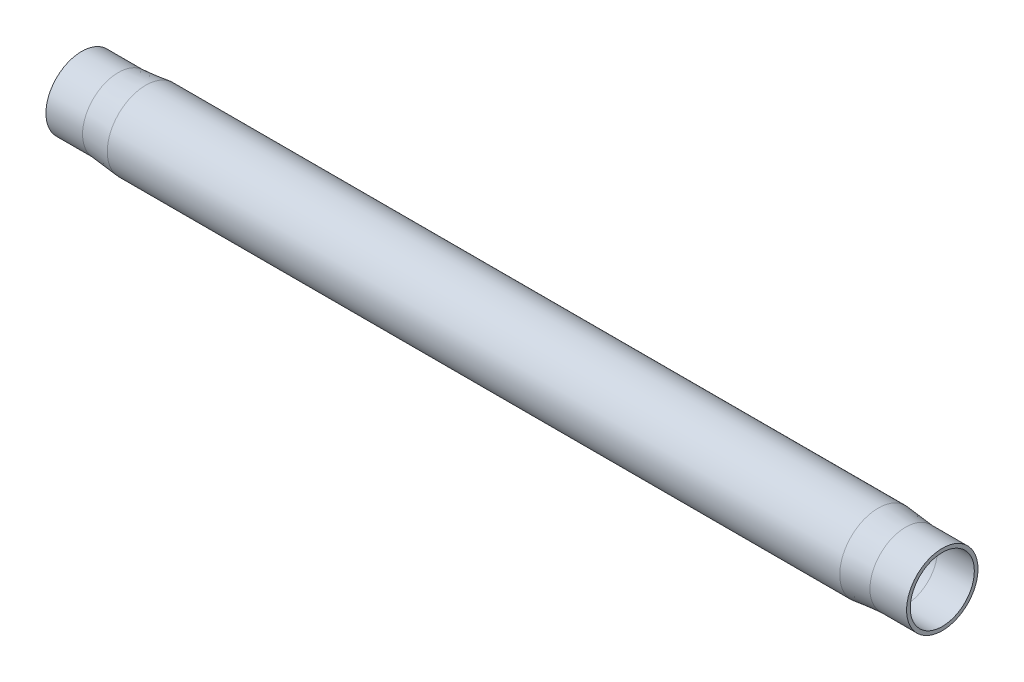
ISO-10303-21;
HEADER;
FILE_DESCRIPTION(('STEP AP214'),'2;1');
FILE_NAME('part.step','',(''),(''),'','','');
FILE_SCHEMA(('AUTOMOTIVE_DESIGN { 1 0 10303 214 1 1 1 1 }'));
ENDSEC;
DATA;
#1=APPLICATION_CONTEXT('core data for automotive mechanical design processes');
#2=APPLICATION_PROTOCOL_DEFINITION('international standard','automotive_design',2000,#1);
#3=PRODUCT_CONTEXT('',#1,'mechanical');
#4=PRODUCT('Part','Part','',(#3));
#5=PRODUCT_RELATED_PRODUCT_CATEGORY('part','',(#4));
#6=PRODUCT_DEFINITION_FORMATION('','',#4);
#7=PRODUCT_DEFINITION_CONTEXT('part definition',#1,'design');
#8=PRODUCT_DEFINITION('design','',#6,#7);
#9=PRODUCT_DEFINITION_SHAPE('','',#8);
#10=(LENGTH_UNIT() NAMED_UNIT(*) SI_UNIT(.MILLI.,.METRE.));
#11=(NAMED_UNIT(*) PLANE_ANGLE_UNIT() SI_UNIT($,.RADIAN.));
#12=(NAMED_UNIT(*) SI_UNIT($,.STERADIAN.) SOLID_ANGLE_UNIT());
#13=UNCERTAINTY_MEASURE_WITH_UNIT(LENGTH_MEASURE(1.E-05),#10,'distance_accuracy_value','');
#14=(GEOMETRIC_REPRESENTATION_CONTEXT(3) GLOBAL_UNCERTAINTY_ASSIGNED_CONTEXT((#13)) GLOBAL_UNIT_ASSIGNED_CONTEXT((#10,
#11,#12)) REPRESENTATION_CONTEXT('',''));
#15=CARTESIAN_POINT('',(0.,0.,0.));
#16=DIRECTION('',(0.,0.,1.));
#17=DIRECTION('',(1.,0.,0.));
#18=AXIS2_PLACEMENT_3D('',#15,#16,#17);
#19=CARTESIAN_POINT('',(-117.5,0.,0.));
#20=DIRECTION('',(1.,0.,0.));
#21=DIRECTION('',(0.,0.,-1.));
#22=AXIS2_PLACEMENT_3D('',#19,#20,#21);
#23=CYLINDRICAL_SURFACE('',#22,19.);
#24=CARTESIAN_POINT('',(-199.900248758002,0.,0.));
#25=DIRECTION('',(1.,0.,0.));
#26=DIRECTION('',(0.,-0.479425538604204,0.877582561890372));
#27=AXIS2_PLACEMENT_3D('',#24,#25,#26);
#28=CIRCLE('',#27,19.0000000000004);
#29=CARTESIAN_POINT('',(-199.900248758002,-9.10908523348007,16.6740686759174));
#30=VERTEX_POINT('',#29);
#31=EDGE_CURVE('E43',#30,#30,#28,.F.);
#32=ORIENTED_EDGE('',*,*,#31,.T.);
#33=EDGE_LOOP('',(#32));
#34=FACE_BOUND('',#33,.T.);
#35=CARTESIAN_POINT('',(199.900248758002,0.,0.));
#36=DIRECTION('',(-1.,0.,0.));
#37=DIRECTION('',(0.,-0.479425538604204,0.877582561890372));
#38=AXIS2_PLACEMENT_3D('',#35,#36,#37);
#39=CIRCLE('',#38,19.0000000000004);
#40=CARTESIAN_POINT('',(199.900248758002,-9.10908523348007,16.6740686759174));
#41=VERTEX_POINT('',#40);
#42=EDGE_CURVE('E40',#41,#41,#39,.F.);
#43=ORIENTED_EDGE('',*,*,#42,.T.);
#44=EDGE_LOOP('',(#43));
#45=FACE_BOUND('',#44,.T.);
#46=ADVANCED_FACE('F13',(#34,#45),#23,.F.);
#47=CARTESIAN_POINT('',(-199.900248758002,0.,0.));
#48=DIRECTION('',(1.,0.,0.));
#49=DIRECTION('',(0.,1.,0.));
#50=AXIS2_PLACEMENT_3D('',#47,#48,#49);
#51=CONICAL_SURFACE('',#50,19.0000000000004,0.0996686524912);
#52=CARTESIAN_POINT('',(-214.900248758,0.,0.));
#53=DIRECTION('',(1.,0.,0.));
#54=DIRECTION('',(0.,0.,-1.));
#55=AXIS2_PLACEMENT_3D('',#52,#53,#54);
#56=CIRCLE('',#55,17.5);
#57=CARTESIAN_POINT('',(-214.900248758,0.,-17.5));
#58=VERTEX_POINT('',#57);
#59=EDGE_CURVE('E37',#58,#58,#56,.F.);
#60=ORIENTED_EDGE('',*,*,#59,.T.);
#61=EDGE_LOOP('',(#60));
#62=FACE_BOUND('',#61,.T.);
#63=ORIENTED_EDGE('',*,*,#31,.F.);
#64=EDGE_LOOP('',(#63));
#65=FACE_BOUND('',#64,.T.);
#66=ADVANCED_FACE('F104',(#62,#65),#51,.F.);
#67=CARTESIAN_POINT('',(199.900248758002,0.,0.));
#68=DIRECTION('',(-1.,0.,0.));
#69=DIRECTION('',(0.,-1.,0.));
#70=AXIS2_PLACEMENT_3D('',#67,#68,#69);
#71=CONICAL_SURFACE('',#70,19.0000000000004,0.0996686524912);
#72=CARTESIAN_POINT('',(214.900248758,0.,0.));
#73=DIRECTION('',(1.,0.,0.));
#74=DIRECTION('',(0.,0.,-1.));
#75=AXIS2_PLACEMENT_3D('',#72,#73,#74);
#76=CIRCLE('',#75,17.5);
#77=CARTESIAN_POINT('',(214.900248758,0.,-17.5));
#78=VERTEX_POINT('',#77);
#79=EDGE_CURVE('E34',#78,#78,#76,.T.);
#80=ORIENTED_EDGE('',*,*,#79,.T.);
#81=EDGE_LOOP('',(#80));
#82=FACE_BOUND('',#81,.T.);
#83=ORIENTED_EDGE('',*,*,#42,.F.);
#84=EDGE_LOOP('',(#83));
#85=FACE_BOUND('',#84,.T.);
#86=ADVANCED_FACE('F102',(#82,#85),#71,.F.);
#87=CARTESIAN_POINT('',(-117.5,0.,0.));
#88=DIRECTION('',(1.,0.,0.));
#89=DIRECTION('',(0.,0.,-1.));
#90=AXIS2_PLACEMENT_3D('',#87,#88,#89);
#91=CYLINDRICAL_SURFACE('',#90,17.5);
#92=CARTESIAN_POINT('',(-235.,0.,0.));
#93=DIRECTION('',(1.,0.,0.));
#94=DIRECTION('',(0.,0.,-1.));
#95=AXIS2_PLACEMENT_3D('',#92,#93,#94);
#96=CIRCLE('',#95,17.5);
#97=CARTESIAN_POINT('',(-235.,0.,-17.5));
#98=VERTEX_POINT('',#97);
#99=EDGE_CURVE('E16',#98,#98,#96,.F.);
#100=ORIENTED_EDGE('',*,*,#99,.T.);
#101=EDGE_LOOP('',(#100));
#102=FACE_BOUND('',#101,.T.);
#103=ORIENTED_EDGE('',*,*,#59,.F.);
#104=EDGE_LOOP('',(#103));
#105=FACE_BOUND('',#104,.T.);
#106=ADVANCED_FACE('F57',(#102,#105),#91,.F.);
#107=CARTESIAN_POINT('',(-117.5,0.,0.));
#108=DIRECTION('',(1.,0.,0.));
#109=DIRECTION('',(0.,0.,-1.));
#110=AXIS2_PLACEMENT_3D('',#107,#108,#109);
#111=CYLINDRICAL_SURFACE('',#110,17.5);
#112=CARTESIAN_POINT('',(235.,0.,0.));
#113=DIRECTION('',(1.,0.,0.));
#114=DIRECTION('',(0.,0.,-1.));
#115=AXIS2_PLACEMENT_3D('',#112,#113,#114);
#116=CIRCLE('',#115,17.5);
#117=CARTESIAN_POINT('',(235.,0.,-17.5));
#118=VERTEX_POINT('',#117);
#119=EDGE_CURVE('E50',#118,#118,#116,.F.);
#120=ORIENTED_EDGE('',*,*,#119,.F.);
#121=EDGE_LOOP('',(#120));
#122=FACE_BOUND('',#121,.T.);
#123=ORIENTED_EDGE('',*,*,#79,.F.);
#124=EDGE_LOOP('',(#123));
#125=FACE_BOUND('',#124,.T.);
#126=ADVANCED_FACE('F64',(#122,#125),#111,.F.);
#127=CARTESIAN_POINT('',(-235.,0.,17.5));
#128=DIRECTION('',(1.,0.,0.));
#129=DIRECTION('',(0.,0.,-1.));
#130=AXIS2_PLACEMENT_3D('',#127,#128,#129);
#131=PLANE('',#130);
#132=ORIENTED_EDGE('',*,*,#99,.F.);
#133=EDGE_LOOP('',(#132));
#134=FACE_BOUND('',#133,.T.);
#135=CARTESIAN_POINT('',(-235.,0.,0.));
#136=DIRECTION('',(1.,0.,0.));
#137=DIRECTION('',(0.,0.,-1.));
#138=AXIS2_PLACEMENT_3D('',#135,#136,#137);
#139=CIRCLE('',#138,19.5);
#140=CARTESIAN_POINT('',(-235.,0.,-19.5));
#141=VERTEX_POINT('',#140);
#142=EDGE_CURVE('E48',#141,#141,#139,.T.);
#143=ORIENTED_EDGE('',*,*,#142,.F.);
#144=EDGE_LOOP('',(#143));
#145=FACE_BOUND('',#144,.T.);
#146=ADVANCED_FACE('F60',(#134,#145),#131,.F.);
#147=CARTESIAN_POINT('',(235.,0.,17.5));
#148=DIRECTION('',(1.,0.,0.));
#149=DIRECTION('',(0.,0.,-1.));
#150=AXIS2_PLACEMENT_3D('',#147,#148,#149);
#151=PLANE('',#150);
#152=ORIENTED_EDGE('',*,*,#119,.T.);
#153=EDGE_LOOP('',(#152));
#154=FACE_BOUND('',#153,.T.);
#155=CARTESIAN_POINT('',(235.,0.,0.));
#156=DIRECTION('',(1.,0.,0.));
#157=DIRECTION('',(0.,0.,-1.));
#158=AXIS2_PLACEMENT_3D('',#155,#156,#157);
#159=CIRCLE('',#158,19.5);
#160=CARTESIAN_POINT('',(235.,0.,-19.5));
#161=VERTEX_POINT('',#160);
#162=EDGE_CURVE('E33',#161,#161,#159,.F.);
#163=ORIENTED_EDGE('',*,*,#162,.F.);
#164=EDGE_LOOP('',(#163));
#165=FACE_BOUND('',#164,.T.);
#166=ADVANCED_FACE('F63',(#154,#165),#151,.T.);
#167=CARTESIAN_POINT('',(-117.5,0.,0.));
#168=DIRECTION('',(1.,0.,0.));
#169=DIRECTION('',(0.,0.,-1.));
#170=AXIS2_PLACEMENT_3D('',#167,#168,#169);
#171=CYLINDRICAL_SURFACE('',#170,19.5);
#172=ORIENTED_EDGE('',*,*,#142,.T.);
#173=EDGE_LOOP('',(#172));
#174=FACE_BOUND('',#173,.T.);
#175=CARTESIAN_POINT('',(-214.999999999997,0.,0.));
#176=DIRECTION('',(1.,0.,0.));
#177=DIRECTION('',(0.,-0.479425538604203,0.877582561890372));
#178=AXIS2_PLACEMENT_3D('',#175,#176,#177);
#179=CIRCLE('',#178,19.5000000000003);
#180=CARTESIAN_POINT('',(-214.999999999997,-9.34879800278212,17.1128599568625));
#181=VERTEX_POINT('',#180);
#182=EDGE_CURVE('E30',#181,#181,#179,.T.);
#183=ORIENTED_EDGE('',*,*,#182,.F.);
#184=EDGE_LOOP('',(#183));
#185=FACE_BOUND('',#184,.T.);
#186=ADVANCED_FACE('F68',(#174,#185),#171,.T.);
#187=CARTESIAN_POINT('',(-117.5,0.,0.));
#188=DIRECTION('',(1.,0.,0.));
#189=DIRECTION('',(0.,0.,-1.));
#190=AXIS2_PLACEMENT_3D('',#187,#188,#189);
#191=CYLINDRICAL_SURFACE('',#190,19.5);
#192=ORIENTED_EDGE('',*,*,#162,.T.);
#193=EDGE_LOOP('',(#192));
#194=FACE_BOUND('',#193,.T.);
#195=CARTESIAN_POINT('',(214.999999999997,0.,0.));
#196=DIRECTION('',(-1.,0.,0.));
#197=DIRECTION('',(0.,-0.479425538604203,0.877582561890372));
#198=AXIS2_PLACEMENT_3D('',#195,#196,#197);
#199=CIRCLE('',#198,19.5000000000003);
#200=CARTESIAN_POINT('',(214.999999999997,-9.34879800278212,17.1128599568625));
#201=VERTEX_POINT('',#200);
#202=EDGE_CURVE('E25',#201,#201,#199,.T.);
#203=ORIENTED_EDGE('',*,*,#202,.F.);
#204=EDGE_LOOP('',(#203));
#205=FACE_BOUND('',#204,.T.);
#206=ADVANCED_FACE('F71',(#194,#205),#191,.T.);
#207=CARTESIAN_POINT('',(-199.999999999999,0.,0.));
#208=DIRECTION('',(1.,0.,0.));
#209=DIRECTION('',(0.,1.,0.));
#210=AXIS2_PLACEMENT_3D('',#207,#208,#209);
#211=CONICAL_SURFACE('',#210,21.0000000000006,0.0996686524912);
#212=ORIENTED_EDGE('',*,*,#182,.T.);
#213=EDGE_LOOP('',(#212));
#214=FACE_BOUND('',#213,.T.);
#215=CARTESIAN_POINT('',(-200.,0.,0.));
#216=DIRECTION('',(1.,0.,0.));
#217=DIRECTION('',(0.,0.,-1.));
#218=AXIS2_PLACEMENT_3D('',#215,#216,#217);
#219=CIRCLE('',#218,21.);
#220=CARTESIAN_POINT('',(-200.,0.,-21.));
#221=VERTEX_POINT('',#220);
#222=EDGE_CURVE('E20',#221,#221,#219,.T.);
#223=ORIENTED_EDGE('',*,*,#222,.F.);
#224=EDGE_LOOP('',(#223));
#225=FACE_BOUND('',#224,.T.);
#226=ADVANCED_FACE('F75',(#214,#225),#211,.T.);
#227=CARTESIAN_POINT('',(199.999999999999,0.,0.));
#228=DIRECTION('',(-1.,0.,0.));
#229=DIRECTION('',(0.,-1.,0.));
#230=AXIS2_PLACEMENT_3D('',#227,#228,#229);
#231=CONICAL_SURFACE('',#230,21.0000000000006,0.0996686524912);
#232=ORIENTED_EDGE('',*,*,#202,.T.);
#233=EDGE_LOOP('',(#232));
#234=FACE_BOUND('',#233,.T.);
#235=CARTESIAN_POINT('',(200.,0.,0.));
#236=DIRECTION('',(1.,0.,0.));
#237=DIRECTION('',(0.,0.,-1.));
#238=AXIS2_PLACEMENT_3D('',#235,#236,#237);
#239=CIRCLE('',#238,21.);
#240=CARTESIAN_POINT('',(200.,0.,-21.));
#241=VERTEX_POINT('',#240);
#242=EDGE_CURVE('E9',#241,#241,#239,.F.);
#243=ORIENTED_EDGE('',*,*,#242,.F.);
#244=EDGE_LOOP('',(#243));
#245=FACE_BOUND('',#244,.T.);
#246=ADVANCED_FACE('F78',(#234,#245),#231,.T.);
#247=CARTESIAN_POINT('',(-117.5,0.,0.));
#248=DIRECTION('',(1.,0.,0.));
#249=DIRECTION('',(0.,0.,-1.));
#250=AXIS2_PLACEMENT_3D('',#247,#248,#249);
#251=CYLINDRICAL_SURFACE('',#250,21.);
#252=ORIENTED_EDGE('',*,*,#222,.T.);
#253=EDGE_LOOP('',(#252));
#254=FACE_BOUND('',#253,.T.);
#255=ORIENTED_EDGE('',*,*,#242,.T.);
#256=EDGE_LOOP('',(#255));
#257=FACE_BOUND('',#256,.T.);
#258=ADVANCED_FACE('F82',(#254,#257),#251,.T.);
#259=CLOSED_SHELL('',(#46,#66,#86,#106,#126,#146,#166,#186,#206,#226,#246,#258));
#260=MANIFOLD_SOLID_BREP('B1',#259);
#261=ADVANCED_BREP_SHAPE_REPRESENTATION('',(#18,#260),#14);
#262=SHAPE_DEFINITION_REPRESENTATION(#9,#261);
ENDSEC;
END-ISO-10303-21;
